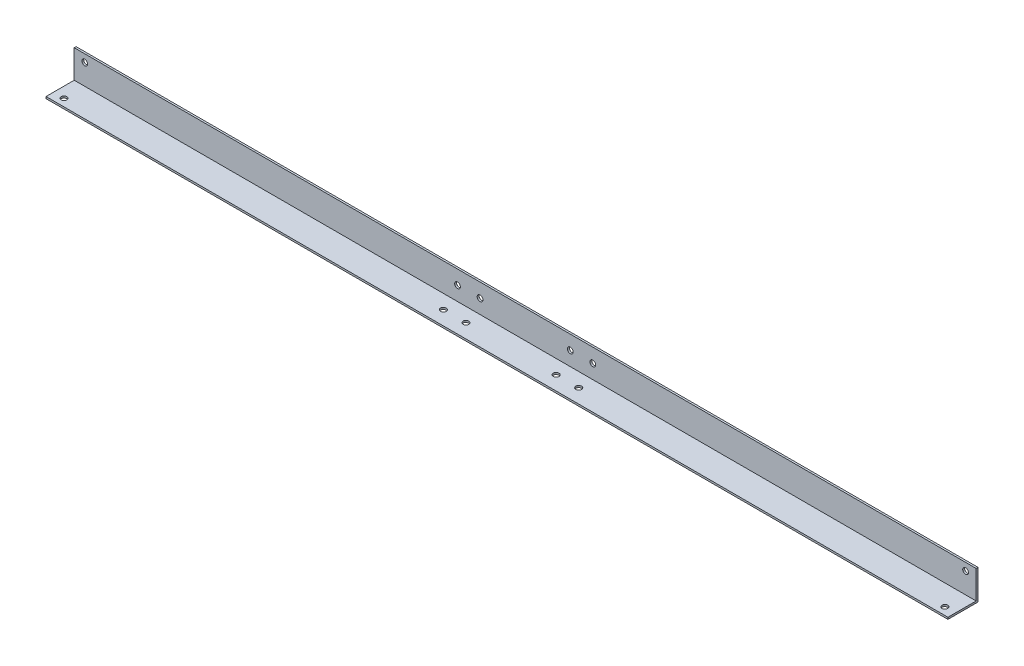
from build123d import *

# Parameters (mm, degrees)
BOSS_EXTRUDE1_DEPTH = 381
SKETCH2_R           = 2.4257
CUT_EXTRUDE1_DEPTH  = 383.689587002


with BuildPart() as part:
    # Sketch1 → Boss-Extrude1 (new, symmetric)
    with BuildSketch(Plane.YZ):
        Polygon((0, 0), (25.4, 0), (25.4, 1.5875), (1.5875, 1.5875), (1.5875, 25.4), (0, 25.4), align=None)
    extrude(amount=BOSS_EXTRUDE1_DEPTH, both=True)

    # Sketch2 → Cut-Extrude1 (cut, through all)
    with BuildSketch(Plane(origin=(0, 0, 0), x_dir=(-1, 0, 0), z_dir=(0, 1, 0))):
        with Locations(Location((-372.11, 19.05, 0), (0, 0, 270))):
            Circle(SKETCH2_R)
        with Locations(Location((372.11, 19.05, 0), (0, 0, 270))):
            Circle(SKETCH2_R)
        with Locations(Location((-57.15, 13.49375, 0), (0, 0, 270))):
            Circle(SKETCH2_R)
        with Locations(Location((-38.1, 13.49375, 0), (0, 0, 270))):
            Circle(SKETCH2_R)
        with Locations(Location((57.15, 13.49375, 0), (0, 0, 270))):
            Circle(SKETCH2_R)
        with Locations(Location((38.1, 13.49375, 0), (0, 0, 270))):
            Circle(SKETCH2_R)
    cut_extrude1 = extrude(amount=CUT_EXTRUDE1_DEPTH, mode=Mode.SUBTRACT)

    # Mirror1: Cut-Extrude1 across plane
    add(cut_extrude1.mirror(Plane(origin=(0, 0, 0), x_dir=(0, 0.7071067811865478, 0.7071067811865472), z_dir=(0, 0.7071067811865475, -0.7071067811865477))), mode=Mode.SUBTRACT)


solid = part.part
